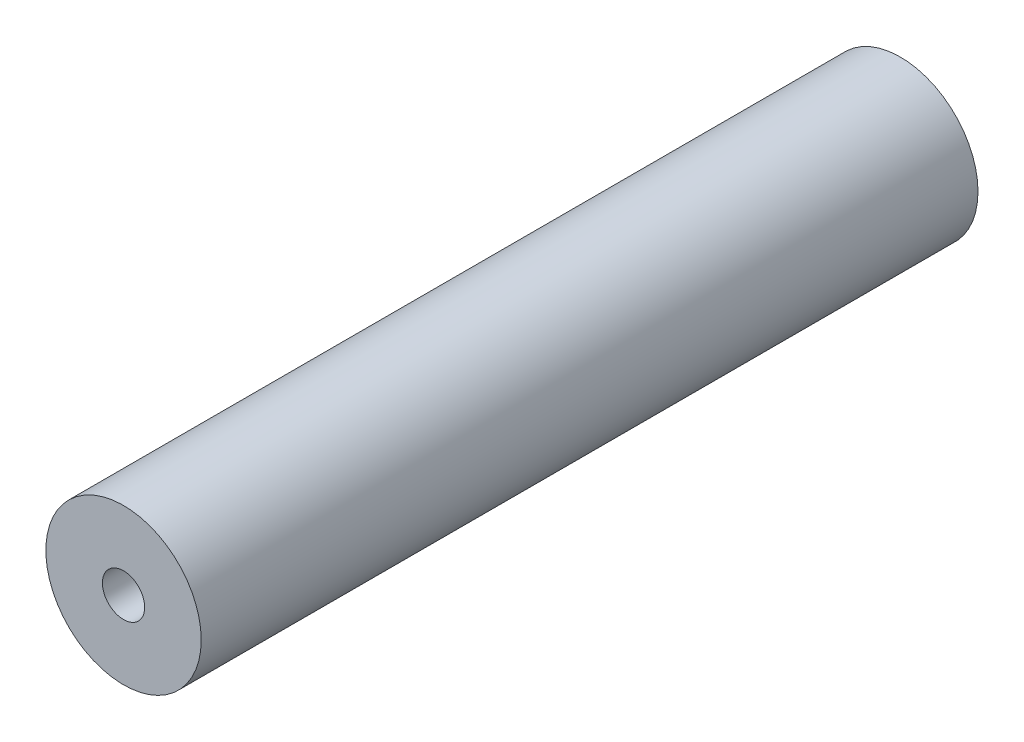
ISO-10303-21;
HEADER;
FILE_DESCRIPTION(('STEP AP214'),'2;1');
FILE_NAME('part.step','',(''),(''),'','','');
FILE_SCHEMA(('AUTOMOTIVE_DESIGN { 1 0 10303 214 1 1 1 1 }'));
ENDSEC;
DATA;
#1=APPLICATION_CONTEXT('core data for automotive mechanical design processes');
#2=APPLICATION_PROTOCOL_DEFINITION('international standard','automotive_design',2000,#1);
#3=PRODUCT_CONTEXT('',#1,'mechanical');
#4=PRODUCT('Part','Part','',(#3));
#5=PRODUCT_RELATED_PRODUCT_CATEGORY('part','',(#4));
#6=PRODUCT_DEFINITION_FORMATION('','',#4);
#7=PRODUCT_DEFINITION_CONTEXT('part definition',#1,'design');
#8=PRODUCT_DEFINITION('design','',#6,#7);
#9=PRODUCT_DEFINITION_SHAPE('','',#8);
#10=(LENGTH_UNIT() NAMED_UNIT(*) SI_UNIT(.MILLI.,.METRE.));
#11=(NAMED_UNIT(*) PLANE_ANGLE_UNIT() SI_UNIT($,.RADIAN.));
#12=(NAMED_UNIT(*) SI_UNIT($,.STERADIAN.) SOLID_ANGLE_UNIT());
#13=UNCERTAINTY_MEASURE_WITH_UNIT(LENGTH_MEASURE(1.E-05),#10,'distance_accuracy_value','');
#14=(GEOMETRIC_REPRESENTATION_CONTEXT(3) GLOBAL_UNCERTAINTY_ASSIGNED_CONTEXT((#13)) GLOBAL_UNIT_ASSIGNED_CONTEXT((#10,
#11,#12)) REPRESENTATION_CONTEXT('',''));
#15=CARTESIAN_POINT('',(0.,0.,0.));
#16=DIRECTION('',(0.,0.,1.));
#17=DIRECTION('',(1.,0.,0.));
#18=AXIS2_PLACEMENT_3D('',#15,#16,#17);
#19=CARTESIAN_POINT('',(0.,0.,62.5));
#20=DIRECTION('',(0.,0.,-1.));
#21=DIRECTION('',(-0.999999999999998,0.,0.));
#22=AXIS2_PLACEMENT_3D('',#19,#20,#21);
#23=CYLINDRICAL_SURFACE('',#22,12.5);
#24=CARTESIAN_POINT('',(0.,0.,62.5));
#25=DIRECTION('',(0.,0.,1.));
#26=DIRECTION('',(0.999999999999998,0.,0.));
#27=AXIS2_PLACEMENT_3D('',#24,#25,#26);
#28=CIRCLE('',#27,12.5);
#29=CARTESIAN_POINT('',(12.5,0.,62.5));
#30=VERTEX_POINT('',#29);
#31=EDGE_CURVE('E11',#30,#30,#28,.T.);
#32=ORIENTED_EDGE('',*,*,#31,.F.);
#33=EDGE_LOOP('',(#32));
#34=FACE_BOUND('',#33,.T.);
#35=CARTESIAN_POINT('',(0.,0.,-62.5000000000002));
#36=DIRECTION('',(0.,0.,1.));
#37=DIRECTION('',(0.999999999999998,0.,0.));
#38=AXIS2_PLACEMENT_3D('',#35,#36,#37);
#39=CIRCLE('',#38,12.5);
#40=CARTESIAN_POINT('',(12.5,0.,-62.5000000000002));
#41=VERTEX_POINT('',#40);
#42=EDGE_CURVE('E49',#41,#41,#39,.T.);
#43=ORIENTED_EDGE('',*,*,#42,.T.);
#44=EDGE_LOOP('',(#43));
#45=FACE_BOUND('',#44,.T.);
#46=ADVANCED_FACE('F46',(#34,#45),#23,.T.);
#47=CARTESIAN_POINT('',(0.,0.,62.5));
#48=DIRECTION('',(0.,0.,1.));
#49=DIRECTION('',(0.999999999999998,0.,0.));
#50=AXIS2_PLACEMENT_3D('',#47,#48,#49);
#51=PLANE('',#50);
#52=CARTESIAN_POINT('',(0.,0.,62.5));
#53=DIRECTION('',(0.,0.,1.));
#54=DIRECTION('',(0.999999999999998,0.,0.));
#55=AXIS2_PLACEMENT_3D('',#52,#53,#54);
#56=CIRCLE('',#55,3.39999999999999);
#57=CARTESIAN_POINT('',(3.39999999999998,0.,62.5));
#58=VERTEX_POINT('',#57);
#59=EDGE_CURVE('E80',#58,#58,#56,.T.);
#60=ORIENTED_EDGE('',*,*,#59,.F.);
#61=EDGE_LOOP('',(#60));
#62=FACE_BOUND('',#61,.T.);
#63=ORIENTED_EDGE('',*,*,#31,.T.);
#64=EDGE_LOOP('',(#63));
#65=FACE_BOUND('',#64,.T.);
#66=ADVANCED_FACE('F93',(#62,#65),#51,.T.);
#67=CARTESIAN_POINT('',(0.,0.,-62.5000000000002));
#68=DIRECTION('',(0.,0.,1.));
#69=DIRECTION('',(0.999999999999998,0.,0.));
#70=AXIS2_PLACEMENT_3D('',#67,#68,#69);
#71=PLANE('',#70);
#72=CARTESIAN_POINT('',(0.,0.,-62.5000000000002));
#73=DIRECTION('',(0.,0.,-1.));
#74=DIRECTION('',(-0.999999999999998,0.,0.));
#75=AXIS2_PLACEMENT_3D('',#72,#73,#74);
#76=CIRCLE('',#75,3.39999999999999);
#77=CARTESIAN_POINT('',(-3.39999999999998,0.,-62.5000000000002));
#78=VERTEX_POINT('',#77);
#79=EDGE_CURVE('E70',#78,#78,#76,.T.);
#80=ORIENTED_EDGE('',*,*,#79,.F.);
#81=EDGE_LOOP('',(#80));
#82=FACE_BOUND('',#81,.T.);
#83=ORIENTED_EDGE('',*,*,#42,.F.);
#84=EDGE_LOOP('',(#83));
#85=FACE_BOUND('',#84,.T.);
#86=ADVANCED_FACE('F90',(#82,#85),#71,.F.);
#87=CARTESIAN_POINT('',(0.,0.,62.5));
#88=DIRECTION('',(0.,0.,1.));
#89=DIRECTION('',(0.999999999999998,0.,0.));
#90=AXIS2_PLACEMENT_3D('',#87,#88,#89);
#91=CYLINDRICAL_SURFACE('',#90,3.39999999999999);
#92=CARTESIAN_POINT('',(0.,0.,40.25));
#93=DIRECTION('',(0.,0.,1.));
#94=DIRECTION('',(0.999999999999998,0.,0.));
#95=AXIS2_PLACEMENT_3D('',#92,#93,#94);
#96=CIRCLE('',#95,3.39999999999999);
#97=CARTESIAN_POINT('',(3.39999999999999,0.,40.25));
#98=VERTEX_POINT('',#97);
#99=EDGE_CURVE('E74',#98,#98,#96,.T.);
#100=ORIENTED_EDGE('',*,*,#99,.F.);
#101=EDGE_LOOP('',(#100));
#102=FACE_BOUND('',#101,.T.);
#103=ORIENTED_EDGE('',*,*,#59,.T.);
#104=EDGE_LOOP('',(#103));
#105=FACE_BOUND('',#104,.T.);
#106=ADVANCED_FACE('F92',(#102,#105),#91,.F.);
#107=CARTESIAN_POINT('',(0.,0.,40.25));
#108=DIRECTION('',(0.,0.,1.));
#109=DIRECTION('',(0.999999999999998,0.,0.));
#110=AXIS2_PLACEMENT_3D('',#107,#108,#109);
#111=CONICAL_SURFACE('',#110,3.39999999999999,1.02974425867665);
#112=CARTESIAN_POINT('',(0.,0.,38.2070738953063));
#113=VERTEX_POINT('',#112);
#114=VERTEX_LOOP('',#113);
#115=FACE_BOUND('',#114,.T.);
#116=ORIENTED_EDGE('',*,*,#99,.T.);
#117=EDGE_LOOP('',(#116));
#118=FACE_BOUND('',#117,.T.);
#119=ADVANCED_FACE('F99',(#115,#118),#111,.F.);
#120=CARTESIAN_POINT('',(0.,0.,-62.5000000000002));
#121=DIRECTION('',(0.,0.,-1.));
#122=DIRECTION('',(-0.999999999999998,0.,0.));
#123=AXIS2_PLACEMENT_3D('',#120,#121,#122);
#124=CYLINDRICAL_SURFACE('',#123,3.39999999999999);
#125=CARTESIAN_POINT('',(0.,0.,-40.2500000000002));
#126=DIRECTION('',(0.,0.,-1.));
#127=DIRECTION('',(-0.999999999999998,0.,0.));
#128=AXIS2_PLACEMENT_3D('',#125,#126,#127);
#129=CIRCLE('',#128,3.39999999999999);
#130=CARTESIAN_POINT('',(-3.39999999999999,0.,-40.2500000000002));
#131=VERTEX_POINT('',#130);
#132=EDGE_CURVE('E67',#131,#131,#129,.T.);
#133=ORIENTED_EDGE('',*,*,#132,.F.);
#134=EDGE_LOOP('',(#133));
#135=FACE_BOUND('',#134,.T.);
#136=ORIENTED_EDGE('',*,*,#79,.T.);
#137=EDGE_LOOP('',(#136));
#138=FACE_BOUND('',#137,.T.);
#139=ADVANCED_FACE('F63',(#135,#138),#124,.F.);
#140=CARTESIAN_POINT('',(0.,0.,-40.2500000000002));
#141=DIRECTION('',(0.,0.,-1.));
#142=DIRECTION('',(-0.999999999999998,0.,0.));
#143=AXIS2_PLACEMENT_3D('',#140,#141,#142);
#144=CONICAL_SURFACE('',#143,3.39999999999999,1.02974425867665);
#145=CARTESIAN_POINT('',(0.,0.,-38.2070738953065));
#146=VERTEX_POINT('',#145);
#147=VERTEX_LOOP('',#146);
#148=FACE_BOUND('',#147,.T.);
#149=ORIENTED_EDGE('',*,*,#132,.T.);
#150=EDGE_LOOP('',(#149));
#151=FACE_BOUND('',#150,.T.);
#152=ADVANCED_FACE('F60',(#148,#151),#144,.F.);
#153=CLOSED_SHELL('',(#46,#66,#86,#106,#119,#139,#152));
#154=MANIFOLD_SOLID_BREP('B2',#153);
#155=ADVANCED_BREP_SHAPE_REPRESENTATION('',(#18,#154),#14);
#156=SHAPE_DEFINITION_REPRESENTATION(#9,#155);
ENDSEC;
END-ISO-10303-21;
